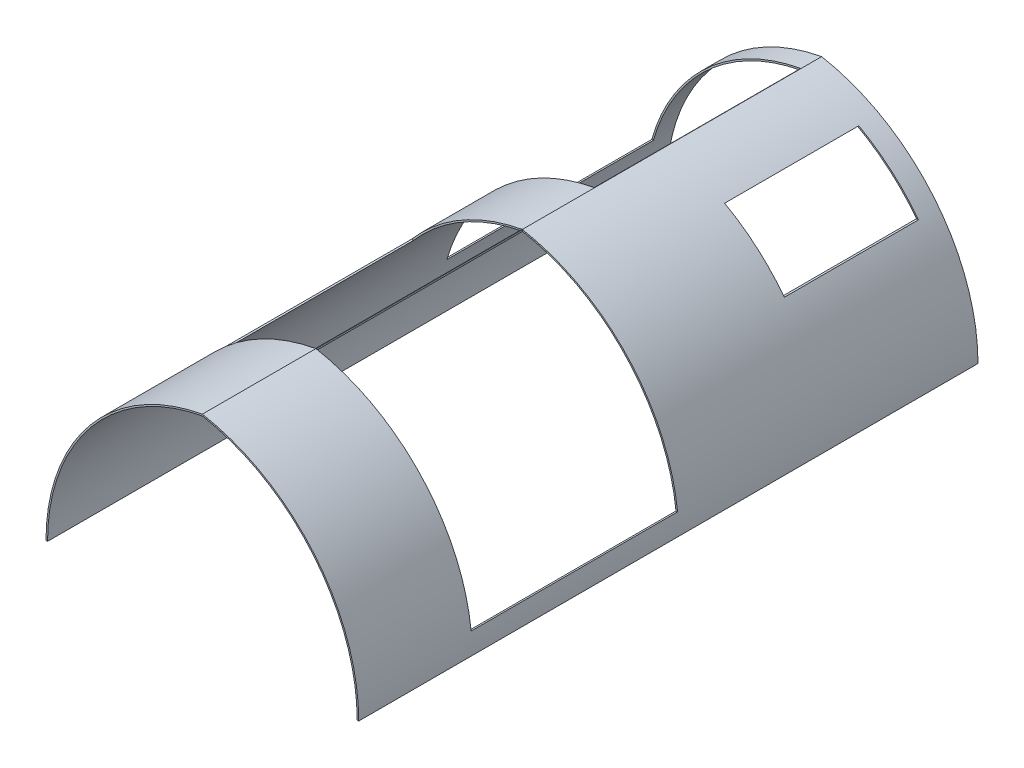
ISO-10303-21;
HEADER;
FILE_DESCRIPTION(('STEP AP214'),'2;1');
FILE_NAME('part.step','',(''),(''),'','','');
FILE_SCHEMA(('AUTOMOTIVE_DESIGN { 1 0 10303 214 1 1 1 1 }'));
ENDSEC;
DATA;
#1=APPLICATION_CONTEXT('core data for automotive mechanical design processes');
#2=APPLICATION_PROTOCOL_DEFINITION('international standard','automotive_design',2000,#1);
#3=PRODUCT_CONTEXT('',#1,'mechanical');
#4=PRODUCT('Part','Part','',(#3));
#5=PRODUCT_RELATED_PRODUCT_CATEGORY('part','',(#4));
#6=PRODUCT_DEFINITION_FORMATION('','',#4);
#7=PRODUCT_DEFINITION_CONTEXT('part definition',#1,'design');
#8=PRODUCT_DEFINITION('design','',#6,#7);
#9=PRODUCT_DEFINITION_SHAPE('','',#8);
#10=(LENGTH_UNIT() NAMED_UNIT(*) SI_UNIT(.MILLI.,.METRE.));
#11=(NAMED_UNIT(*) PLANE_ANGLE_UNIT() SI_UNIT($,.RADIAN.));
#12=(NAMED_UNIT(*) SI_UNIT($,.STERADIAN.) SOLID_ANGLE_UNIT());
#13=UNCERTAINTY_MEASURE_WITH_UNIT(LENGTH_MEASURE(1.E-05),#10,'distance_accuracy_value','');
#14=(GEOMETRIC_REPRESENTATION_CONTEXT(3) GLOBAL_UNCERTAINTY_ASSIGNED_CONTEXT((#13)) GLOBAL_UNIT_ASSIGNED_CONTEXT((#10,
#11,#12)) REPRESENTATION_CONTEXT('',''));
#15=CARTESIAN_POINT('',(0.,0.,0.));
#16=DIRECTION('',(0.,0.,1.));
#17=DIRECTION('',(1.,0.,0.));
#18=AXIS2_PLACEMENT_3D('',#15,#16,#17);
#19=CARTESIAN_POINT('',(351.335117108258,-91.3706169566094,6000.));
#20=DIRECTION('',(0.,0.,-1.));
#21=DIRECTION('',(-1.,0.,0.));
#22=AXIS2_PLACEMENT_3D('',#19,#20,#21);
#23=CYLINDRICAL_SURFACE('',#22,1833.03652149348);
#24=CARTESIAN_POINT('',(351.335117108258,-91.3706169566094,2200.));
#25=DIRECTION('',(0.,0.,-1.));
#26=DIRECTION('',(-1.,0.,0.));
#27=AXIS2_PLACEMENT_3D('',#24,#25,#26);
#28=CIRCLE('',#27,1833.03652149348);
#29=CARTESIAN_POINT('',(14.9999999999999,1710.54546825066,2200.));
#30=VERTEX_POINT('',#29);
#31=CARTESIAN_POINT('',(-1412.19058135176,408.629383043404,2200.));
#32=VERTEX_POINT('',#31);
#33=EDGE_CURVE('E218',#30,#32,#28,.F.);
#34=ORIENTED_EDGE('',*,*,#33,.F.);
#35=DIRECTION('',(0.,0.,-1.));
#36=VECTOR('',#35,1.);
#37=CARTESIAN_POINT('',(14.9999999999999,1710.54546825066,6000.));
#38=LINE('',#37,#36);
#39=CARTESIAN_POINT('',(14.9999999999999,1710.54546825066,199.999999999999));
#40=VERTEX_POINT('',#39);
#41=EDGE_CURVE('E209',#30,#40,#38,.T.);
#42=ORIENTED_EDGE('',*,*,#41,.T.);
#43=CARTESIAN_POINT('',(351.335117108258,-91.3706169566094,200.));
#44=DIRECTION('',(0.,0.,-1.));
#45=DIRECTION('',(0.,1.,0.));
#46=AXIS2_PLACEMENT_3D('',#43,#44,#45);
#47=CIRCLE('',#46,1833.03652149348);
#48=CARTESIAN_POINT('',(-1412.19058135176,408.629383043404,200.));
#49=VERTEX_POINT('',#48);
#50=EDGE_CURVE('E212',#40,#49,#47,.F.);
#51=ORIENTED_EDGE('',*,*,#50,.T.);
#52=DIRECTION('',(0.,0.,-1.));
#53=VECTOR('',#52,1.);
#54=CARTESIAN_POINT('',(-1412.19058135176,408.629383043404,6000.));
#55=LINE('',#54,#53);
#56=EDGE_CURVE('E215',#49,#32,#55,.F.);
#57=ORIENTED_EDGE('',*,*,#56,.T.);
#58=EDGE_LOOP('',(#34,#42,#51,#57));
#59=FACE_BOUND('',#58,.T.);
#60=CARTESIAN_POINT('',(351.335117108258,-91.3706169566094,0.));
#61=DIRECTION('',(0.,0.,-1.));
#62=DIRECTION('',(-1.,0.,0.));
#63=AXIS2_PLACEMENT_3D('',#60,#61,#62);
#64=CIRCLE('',#63,1833.03652149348);
#65=CARTESIAN_POINT('',(-1481.70140438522,-91.3706169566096,0.));
#66=VERTEX_POINT('',#65);
#67=CARTESIAN_POINT('',(18.2985956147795,1711.15804147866,0.));
#68=VERTEX_POINT('',#67);
#69=EDGE_CURVE('E263',#66,#68,#64,.T.);
#70=ORIENTED_EDGE('',*,*,#69,.T.);
#71=DIRECTION('',(0.,0.,-1.));
#72=VECTOR('',#71,1.);
#73=CARTESIAN_POINT('',(18.2985956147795,1711.15804147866,6000.));
#74=LINE('',#73,#72);
#75=CARTESIAN_POINT('',(18.2985956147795,1711.15804147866,6000.));
#76=VERTEX_POINT('',#75);
#77=EDGE_CURVE('E304',#76,#68,#74,.T.);
#78=ORIENTED_EDGE('',*,*,#77,.F.);
#79=CARTESIAN_POINT('',(351.335117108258,-91.3706169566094,6000.));
#80=DIRECTION('',(0.,0.,-1.));
#81=DIRECTION('',(-1.,0.,0.));
#82=AXIS2_PLACEMENT_3D('',#79,#80,#81);
#83=CIRCLE('',#82,1833.03652149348);
#84=CARTESIAN_POINT('',(-1481.70140438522,-91.3706169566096,6000.));
#85=VERTEX_POINT('',#84);
#86=EDGE_CURVE('E264',#85,#76,#83,.T.);
#87=ORIENTED_EDGE('',*,*,#86,.F.);
#88=DIRECTION('',(0.,0.,-1.));
#89=VECTOR('',#88,1.);
#90=CARTESIAN_POINT('',(-1481.70140438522,-91.3706169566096,6000.));
#91=LINE('',#90,#89);
#92=EDGE_CURVE('E278',#85,#66,#91,.T.);
#93=ORIENTED_EDGE('',*,*,#92,.T.);
#94=EDGE_LOOP('',(#70,#78,#87,#93));
#95=FACE_BOUND('',#94,.T.);
#96=CARTESIAN_POINT('',(351.335117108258,-91.3706169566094,4900.));
#97=DIRECTION('',(0.,0.,-1.));
#98=DIRECTION('',(-1.,0.,0.));
#99=AXIS2_PLACEMENT_3D('',#96,#97,#98);
#100=CIRCLE('',#99,1833.03652149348);
#101=CARTESIAN_POINT('',(14.9999999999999,1710.54546825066,4900.));
#102=VERTEX_POINT('',#101);
#103=CARTESIAN_POINT('',(-1034.31378832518,1108.6293830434,4900.));
#104=VERTEX_POINT('',#103);
#105=EDGE_CURVE('E187',#102,#104,#100,.F.);
#106=ORIENTED_EDGE('',*,*,#105,.F.);
#107=DIRECTION('',(0.,0.,-1.));
#108=VECTOR('',#107,1.);
#109=CARTESIAN_POINT('',(14.9999999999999,1710.54546825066,6000.));
#110=LINE('',#109,#108);
#111=CARTESIAN_POINT('',(14.9999999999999,1710.54546825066,2900.));
#112=VERTEX_POINT('',#111);
#113=EDGE_CURVE('E176',#102,#112,#110,.T.);
#114=ORIENTED_EDGE('',*,*,#113,.T.);
#115=CARTESIAN_POINT('',(351.335117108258,-91.3706169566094,2900.));
#116=DIRECTION('',(0.,0.,-1.));
#117=DIRECTION('',(-1.,0.,0.));
#118=AXIS2_PLACEMENT_3D('',#115,#116,#117);
#119=CIRCLE('',#118,1833.03652149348);
#120=CARTESIAN_POINT('',(-1034.31378832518,1108.6293830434,2900.));
#121=VERTEX_POINT('',#120);
#122=EDGE_CURVE('E181',#112,#121,#119,.F.);
#123=ORIENTED_EDGE('',*,*,#122,.T.);
#124=DIRECTION('',(0.,0.,-1.));
#125=VECTOR('',#124,1.);
#126=CARTESIAN_POINT('',(-1034.31378832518,1108.6293830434,6000.));
#127=LINE('',#126,#125);
#128=EDGE_CURVE('E193',#121,#104,#127,.F.);
#129=ORIENTED_EDGE('',*,*,#128,.T.);
#130=EDGE_LOOP('',(#106,#114,#123,#129));
#131=FACE_BOUND('',#130,.T.);
#132=ADVANCED_FACE('F32',(#59,#95,#131),#23,.F.);
#133=CARTESIAN_POINT('',(351.335117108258,-91.3706169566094,6000.));
#134=DIRECTION('',(0.,0.,-1.));
#135=DIRECTION('',(-1.,0.,0.));
#136=AXIS2_PLACEMENT_3D('',#133,#134,#135);
#137=CYLINDRICAL_SURFACE('',#136,1848.03652149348);
#138=CARTESIAN_POINT('',(351.335117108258,-91.3706169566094,2200.));
#139=DIRECTION('',(0.,0.,-1.));
#140=DIRECTION('',(-1.,0.,0.));
#141=AXIS2_PLACEMENT_3D('',#138,#139,#140);
#142=CIRCLE('',#141,1848.03652149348);
#143=CARTESIAN_POINT('',(-1427.77673569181,408.629383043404,2200.));
#144=VERTEX_POINT('',#143);
#145=CARTESIAN_POINT('',(14.9999999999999,1725.8023725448,2200.));
#146=VERTEX_POINT('',#145);
#147=EDGE_CURVE('E337',#144,#146,#142,.T.);
#148=ORIENTED_EDGE('',*,*,#147,.F.);
#149=DIRECTION('',(0.,0.,-1.));
#150=VECTOR('',#149,1.);
#151=CARTESIAN_POINT('',(-1427.77673569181,408.629383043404,6000.));
#152=LINE('',#151,#150);
#153=CARTESIAN_POINT('',(-1427.77673569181,408.629383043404,200.));
#154=VERTEX_POINT('',#153);
#155=EDGE_CURVE('E334',#144,#154,#152,.T.);
#156=ORIENTED_EDGE('',*,*,#155,.T.);
#157=CARTESIAN_POINT('',(351.335117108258,-91.3706169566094,200.));
#158=DIRECTION('',(0.,0.,-1.));
#159=DIRECTION('',(0.,1.,0.));
#160=AXIS2_PLACEMENT_3D('',#157,#158,#159);
#161=CIRCLE('',#160,1848.03652149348);
#162=CARTESIAN_POINT('',(14.9999999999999,1725.8023725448,200.));
#163=VERTEX_POINT('',#162);
#164=EDGE_CURVE('E331',#154,#163,#161,.T.);
#165=ORIENTED_EDGE('',*,*,#164,.T.);
#166=DIRECTION('',(0.,0.,-1.));
#167=VECTOR('',#166,1.);
#168=CARTESIAN_POINT('',(14.9999999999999,1725.8023725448,6000.));
#169=LINE('',#168,#167);
#170=EDGE_CURVE('E328',#163,#146,#169,.F.);
#171=ORIENTED_EDGE('',*,*,#170,.T.);
#172=EDGE_LOOP('',(#148,#156,#165,#171));
#173=FACE_BOUND('',#172,.T.);
#174=CARTESIAN_POINT('',(351.335117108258,-91.3706169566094,0.));
#175=DIRECTION('',(0.,0.,1.));
#176=DIRECTION('',(-1.,0.,0.));
#177=AXIS2_PLACEMENT_3D('',#174,#175,#176);
#178=CIRCLE('',#177,1848.03652149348);
#179=CARTESIAN_POINT('',(18.2985956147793,1726.40980436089,0.));
#180=VERTEX_POINT('',#179);
#181=CARTESIAN_POINT('',(-1496.70140438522,-91.3706169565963,0.));
#182=VERTEX_POINT('',#181);
#183=EDGE_CURVE('E287',#180,#182,#178,.T.);
#184=ORIENTED_EDGE('',*,*,#183,.T.);
#185=DIRECTION('',(0.,0.,-1.));
#186=VECTOR('',#185,1.);
#187=CARTESIAN_POINT('',(-1496.70140438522,-91.3706169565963,6000.));
#188=LINE('',#187,#186);
#189=CARTESIAN_POINT('',(-1496.70140438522,-91.3706169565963,6000.));
#190=VERTEX_POINT('',#189);
#191=EDGE_CURVE('E292',#190,#182,#188,.T.);
#192=ORIENTED_EDGE('',*,*,#191,.F.);
#193=CARTESIAN_POINT('',(351.335117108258,-91.3706169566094,6000.));
#194=DIRECTION('',(0.,0.,1.));
#195=DIRECTION('',(-1.,0.,0.));
#196=AXIS2_PLACEMENT_3D('',#193,#194,#195);
#197=CIRCLE('',#196,1848.03652149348);
#198=CARTESIAN_POINT('',(18.2985956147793,1726.40980436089,6000.));
#199=VERTEX_POINT('',#198);
#200=EDGE_CURVE('E274',#199,#190,#197,.T.);
#201=ORIENTED_EDGE('',*,*,#200,.F.);
#202=DIRECTION('',(0.,0.,-1.));
#203=VECTOR('',#202,1.);
#204=CARTESIAN_POINT('',(18.2985956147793,1726.40980436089,6000.));
#205=LINE('',#204,#203);
#206=EDGE_CURVE('E295',#199,#180,#205,.T.);
#207=ORIENTED_EDGE('',*,*,#206,.T.);
#208=EDGE_LOOP('',(#184,#192,#201,#207));
#209=FACE_BOUND('',#208,.T.);
#210=CARTESIAN_POINT('',(351.335117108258,-91.3706169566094,4900.));
#211=DIRECTION('',(0.,0.,-1.));
#212=DIRECTION('',(-1.,0.,0.));
#213=AXIS2_PLACEMENT_3D('',#210,#211,#212);
#214=CIRCLE('',#213,1848.03652149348);
#215=CARTESIAN_POINT('',(-1054.09683954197,1108.6293830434,4900.));
#216=VERTEX_POINT('',#215);
#217=CARTESIAN_POINT('',(14.9999999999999,1725.8023725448,4900.));
#218=VERTEX_POINT('',#217);
#219=EDGE_CURVE('E11',#216,#218,#214,.T.);
#220=ORIENTED_EDGE('',*,*,#219,.F.);
#221=DIRECTION('',(0.,0.,-1.));
#222=VECTOR('',#221,1.);
#223=CARTESIAN_POINT('',(-1054.09683954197,1108.6293830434,6000.));
#224=LINE('',#223,#222);
#225=CARTESIAN_POINT('',(-1054.09683954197,1108.6293830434,2900.));
#226=VERTEX_POINT('',#225);
#227=EDGE_CURVE('E39',#216,#226,#224,.T.);
#228=ORIENTED_EDGE('',*,*,#227,.T.);
#229=CARTESIAN_POINT('',(351.335117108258,-91.3706169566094,2900.));
#230=DIRECTION('',(0.,0.,-1.));
#231=DIRECTION('',(-1.,0.,0.));
#232=AXIS2_PLACEMENT_3D('',#229,#230,#231);
#233=CIRCLE('',#232,1848.03652149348);
#234=CARTESIAN_POINT('',(14.9999999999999,1725.8023725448,2900.));
#235=VERTEX_POINT('',#234);
#236=EDGE_CURVE('E342',#226,#235,#233,.T.);
#237=ORIENTED_EDGE('',*,*,#236,.T.);
#238=DIRECTION('',(0.,0.,-1.));
#239=VECTOR('',#238,1.);
#240=CARTESIAN_POINT('',(14.9999999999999,1725.8023725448,6000.));
#241=LINE('',#240,#239);
#242=EDGE_CURVE('E340',#235,#218,#241,.F.);
#243=ORIENTED_EDGE('',*,*,#242,.T.);
#244=EDGE_LOOP('',(#220,#228,#237,#243));
#245=FACE_BOUND('',#244,.T.);
#246=ADVANCED_FACE('F346',(#173,#209,#245),#137,.T.);
#247=CARTESIAN_POINT('',(-314.737925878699,-91.3706169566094,6000.));
#248=DIRECTION('',(0.,0.,-1.));
#249=DIRECTION('',(-1.,0.,0.));
#250=AXIS2_PLACEMENT_3D('',#247,#248,#249);
#251=CYLINDRICAL_SURFACE('',#250,1833.03652149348);
#252=CARTESIAN_POINT('',(-314.737925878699,-91.3706169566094,4900.));
#253=DIRECTION('',(0.,0.,-1.));
#254=DIRECTION('',(-1.,0.,0.));
#255=AXIS2_PLACEMENT_3D('',#252,#253,#254);
#256=CIRCLE('',#255,1833.03652149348);
#257=CARTESIAN_POINT('',(1507.35507096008,108.629383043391,4900.));
#258=VERTEX_POINT('',#257);
#259=CARTESIAN_POINT('',(20.,1710.84285821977,4900.));
#260=VERTEX_POINT('',#259);
#261=EDGE_CURVE('E236',#258,#260,#256,.F.);
#262=ORIENTED_EDGE('',*,*,#261,.F.);
#263=DIRECTION('',(0.,0.,-1.));
#264=VECTOR('',#263,1.);
#265=CARTESIAN_POINT('',(1507.35507096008,108.629383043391,6000.));
#266=LINE('',#265,#264);
#267=CARTESIAN_POINT('',(1507.35507096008,108.629383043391,2900.));
#268=VERTEX_POINT('',#267);
#269=EDGE_CURVE('E239',#258,#268,#266,.T.);
#270=ORIENTED_EDGE('',*,*,#269,.T.);
#271=CARTESIAN_POINT('',(-314.737925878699,-91.3706169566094,2900.));
#272=DIRECTION('',(0.,0.,-1.));
#273=DIRECTION('',(-1.,0.,0.));
#274=AXIS2_PLACEMENT_3D('',#271,#272,#273);
#275=CIRCLE('',#274,1833.03652149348);
#276=CARTESIAN_POINT('',(20.,1710.84285821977,2900.));
#277=VERTEX_POINT('',#276);
#278=EDGE_CURVE('E233',#268,#277,#275,.F.);
#279=ORIENTED_EDGE('',*,*,#278,.T.);
#280=DIRECTION('',(0.,0.,-1.));
#281=VECTOR('',#280,1.);
#282=CARTESIAN_POINT('',(20.,1710.84285821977,6000.));
#283=LINE('',#282,#281);
#284=EDGE_CURVE('E229',#260,#277,#283,.T.);
#285=ORIENTED_EDGE('',*,*,#284,.F.);
#286=EDGE_LOOP('',(#262,#270,#279,#285));
#287=FACE_BOUND('',#286,.T.);
#288=CARTESIAN_POINT('',(-314.737925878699,-91.3706169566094,0.));
#289=DIRECTION('',(0.,0.,-1.));
#290=DIRECTION('',(1.,0.,0.));
#291=AXIS2_PLACEMENT_3D('',#288,#289,#290);
#292=CIRCLE('',#291,1833.03652149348);
#293=CARTESIAN_POINT('',(1518.29859561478,-91.3706169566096,0.));
#294=VERTEX_POINT('',#293);
#295=EDGE_CURVE('E281',#68,#294,#292,.T.);
#296=ORIENTED_EDGE('',*,*,#295,.T.);
#297=DIRECTION('',(0.,0.,-1.));
#298=VECTOR('',#297,1.);
#299=CARTESIAN_POINT('',(1518.29859561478,-91.3706169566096,6000.));
#300=LINE('',#299,#298);
#301=CARTESIAN_POINT('',(1518.29859561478,-91.3706169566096,6000.));
#302=VERTEX_POINT('',#301);
#303=EDGE_CURVE('E301',#302,#294,#300,.T.);
#304=ORIENTED_EDGE('',*,*,#303,.F.);
#305=CARTESIAN_POINT('',(-314.737925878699,-91.3706169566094,6000.));
#306=DIRECTION('',(0.,0.,-1.));
#307=DIRECTION('',(1.,0.,0.));
#308=AXIS2_PLACEMENT_3D('',#305,#306,#307);
#309=CIRCLE('',#308,1833.03652149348);
#310=EDGE_CURVE('E267',#76,#302,#309,.T.);
#311=ORIENTED_EDGE('',*,*,#310,.F.);
#312=ORIENTED_EDGE('',*,*,#77,.T.);
#313=EDGE_LOOP('',(#296,#304,#311,#312));
#314=FACE_BOUND('',#313,.T.);
#315=CARTESIAN_POINT('',(-314.737925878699,-91.3706169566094,200.));
#316=DIRECTION('',(0.,0.,1.));
#317=DIRECTION('',(1.,0.,0.));
#318=AXIS2_PLACEMENT_3D('',#315,#316,#317);
#319=CIRCLE('',#318,1833.03652149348);
#320=CARTESIAN_POINT('',(547.125983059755,1526.40980436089,200.));
#321=VERTEX_POINT('',#320);
#322=CARTESIAN_POINT('',(1138.04898858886,1026.40980436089,200.));
#323=VERTEX_POINT('',#322);
#324=EDGE_CURVE('E261',#321,#323,#319,.F.);
#325=ORIENTED_EDGE('',*,*,#324,.F.);
#326=DIRECTION('',(0.,0.,-1.));
#327=VECTOR('',#326,1.);
#328=CARTESIAN_POINT('',(547.125983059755,1526.40980436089,6000.));
#329=LINE('',#328,#327);
#330=CARTESIAN_POINT('',(547.125983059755,1526.40980436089,1500.));
#331=VERTEX_POINT('',#330);
#332=EDGE_CURVE('E246',#331,#321,#329,.T.);
#333=ORIENTED_EDGE('',*,*,#332,.F.);
#334=CARTESIAN_POINT('',(-314.737925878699,-91.3706169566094,1500.));
#335=DIRECTION('',(0.,0.,1.));
#336=DIRECTION('',(1.,0.,0.));
#337=AXIS2_PLACEMENT_3D('',#334,#335,#336);
#338=CIRCLE('',#337,1833.03652149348);
#339=CARTESIAN_POINT('',(1138.04898858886,1026.40980436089,1500.));
#340=VERTEX_POINT('',#339);
#341=EDGE_CURVE('E255',#331,#340,#338,.F.);
#342=ORIENTED_EDGE('',*,*,#341,.T.);
#343=DIRECTION('',(0.,0.,-1.));
#344=VECTOR('',#343,1.);
#345=CARTESIAN_POINT('',(1138.04898858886,1026.40980436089,6000.));
#346=LINE('',#345,#344);
#347=EDGE_CURVE('E258',#340,#323,#346,.T.);
#348=ORIENTED_EDGE('',*,*,#347,.T.);
#349=EDGE_LOOP('',(#325,#333,#342,#348));
#350=FACE_BOUND('',#349,.T.);
#351=ADVANCED_FACE('F370',(#287,#314,#350),#251,.F.);
#352=CARTESIAN_POINT('',(-314.737925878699,-91.3706169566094,6000.));
#353=DIRECTION('',(0.,0.,-1.));
#354=DIRECTION('',(-1.,0.,0.));
#355=AXIS2_PLACEMENT_3D('',#352,#353,#354);
#356=CYLINDRICAL_SURFACE('',#355,1848.03652149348);
#357=CARTESIAN_POINT('',(-314.737925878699,-91.3706169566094,2900.));
#358=DIRECTION('',(0.,0.,-1.));
#359=DIRECTION('',(-1.,0.,0.));
#360=AXIS2_PLACEMENT_3D('',#357,#358,#359);
#361=CIRCLE('',#360,1848.03652149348);
#362=CARTESIAN_POINT('',(20.,1726.09726604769,2900.));
#363=VERTEX_POINT('',#362);
#364=CARTESIAN_POINT('',(1522.44442347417,108.629383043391,2900.));
#365=VERTEX_POINT('',#364);
#366=EDGE_CURVE('E320',#363,#365,#361,.T.);
#367=ORIENTED_EDGE('',*,*,#366,.T.);
#368=DIRECTION('',(0.,0.,-1.));
#369=VECTOR('',#368,1.);
#370=CARTESIAN_POINT('',(1522.44442347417,108.629383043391,6000.));
#371=LINE('',#370,#369);
#372=CARTESIAN_POINT('',(1522.44442347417,108.629383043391,4900.));
#373=VERTEX_POINT('',#372);
#374=EDGE_CURVE('E325',#365,#373,#371,.F.);
#375=ORIENTED_EDGE('',*,*,#374,.T.);
#376=CARTESIAN_POINT('',(-314.737925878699,-91.3706169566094,4900.));
#377=DIRECTION('',(0.,0.,-1.));
#378=DIRECTION('',(-1.,0.,0.));
#379=AXIS2_PLACEMENT_3D('',#376,#377,#378);
#380=CIRCLE('',#379,1848.03652149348);
#381=CARTESIAN_POINT('',(20.,1726.09726604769,4900.));
#382=VERTEX_POINT('',#381);
#383=EDGE_CURVE('E323',#382,#373,#380,.T.);
#384=ORIENTED_EDGE('',*,*,#383,.F.);
#385=DIRECTION('',(0.,0.,-1.));
#386=VECTOR('',#385,1.);
#387=CARTESIAN_POINT('',(20.,1726.09726604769,6000.));
#388=LINE('',#387,#386);
#389=EDGE_CURVE('E318',#363,#382,#388,.F.);
#390=ORIENTED_EDGE('',*,*,#389,.F.);
#391=EDGE_LOOP('',(#367,#375,#384,#390));
#392=FACE_BOUND('',#391,.T.);
#393=CARTESIAN_POINT('',(-314.737925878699,-91.3706169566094,0.));
#394=DIRECTION('',(0.,0.,1.));
#395=DIRECTION('',(1.,0.,0.));
#396=AXIS2_PLACEMENT_3D('',#393,#394,#395);
#397=CIRCLE('',#396,1848.03652149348);
#398=CARTESIAN_POINT('',(1533.29859561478,-91.3706169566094,0.));
#399=VERTEX_POINT('',#398);
#400=EDGE_CURVE('E285',#399,#180,#397,.T.);
#401=ORIENTED_EDGE('',*,*,#400,.T.);
#402=ORIENTED_EDGE('',*,*,#206,.F.);
#403=CARTESIAN_POINT('',(-314.737925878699,-91.3706169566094,6000.));
#404=DIRECTION('',(0.,0.,1.));
#405=DIRECTION('',(1.,0.,0.));
#406=AXIS2_PLACEMENT_3D('',#403,#404,#405);
#407=CIRCLE('',#406,1848.03652149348);
#408=CARTESIAN_POINT('',(1533.29859561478,-91.3706169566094,6000.));
#409=VERTEX_POINT('',#408);
#410=EDGE_CURVE('E272',#409,#199,#407,.T.);
#411=ORIENTED_EDGE('',*,*,#410,.F.);
#412=DIRECTION('',(0.,0.,-1.));
#413=VECTOR('',#412,1.);
#414=CARTESIAN_POINT('',(1533.29859561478,-91.3706169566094,6000.));
#415=LINE('',#414,#413);
#416=EDGE_CURVE('E298',#409,#399,#415,.T.);
#417=ORIENTED_EDGE('',*,*,#416,.T.);
#418=EDGE_LOOP('',(#401,#402,#411,#417));
#419=FACE_BOUND('',#418,.T.);
#420=CARTESIAN_POINT('',(-314.737925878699,-91.3706169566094,200.));
#421=DIRECTION('',(0.,0.,1.));
#422=DIRECTION('',(1.,0.,0.));
#423=AXIS2_PLACEMENT_3D('',#420,#421,#422);
#424=CIRCLE('',#423,1848.03652149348);
#425=CARTESIAN_POINT('',(1156.92980648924,1026.40980436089,200.));
#426=VERTEX_POINT('',#425);
#427=CARTESIAN_POINT('',(578.584800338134,1526.40980436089,199.999999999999));
#428=VERTEX_POINT('',#427);
#429=EDGE_CURVE('E315',#426,#428,#424,.T.);
#430=ORIENTED_EDGE('',*,*,#429,.F.);
#431=DIRECTION('',(0.,0.,-1.));
#432=VECTOR('',#431,1.);
#433=CARTESIAN_POINT('',(1156.92980648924,1026.40980436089,6000.));
#434=LINE('',#433,#432);
#435=CARTESIAN_POINT('',(1156.92980648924,1026.40980436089,1500.));
#436=VERTEX_POINT('',#435);
#437=EDGE_CURVE('E312',#426,#436,#434,.F.);
#438=ORIENTED_EDGE('',*,*,#437,.T.);
#439=CARTESIAN_POINT('',(-314.737925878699,-91.3706169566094,1500.));
#440=DIRECTION('',(0.,0.,1.));
#441=DIRECTION('',(1.,0.,0.));
#442=AXIS2_PLACEMENT_3D('',#439,#440,#441);
#443=CIRCLE('',#442,1848.03652149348);
#444=CARTESIAN_POINT('',(578.584800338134,1526.40980436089,1500.));
#445=VERTEX_POINT('',#444);
#446=EDGE_CURVE('E309',#436,#445,#443,.T.);
#447=ORIENTED_EDGE('',*,*,#446,.T.);
#448=DIRECTION('',(0.,0.,-1.));
#449=VECTOR('',#448,1.);
#450=CARTESIAN_POINT('',(578.584800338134,1526.40980436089,6000.));
#451=LINE('',#450,#449);
#452=EDGE_CURVE('E307',#428,#445,#451,.F.);
#453=ORIENTED_EDGE('',*,*,#452,.F.);
#454=EDGE_LOOP('',(#430,#438,#447,#453));
#455=FACE_BOUND('',#454,.T.);
#456=ADVANCED_FACE('F399',(#392,#419,#455),#356,.T.);
#457=CARTESIAN_POINT('',(1518.29859561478,-91.3706169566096,6000.));
#458=DIRECTION('',(0.,1.,0.));
#459=DIRECTION('',(-1.,0.,0.));
#460=AXIS2_PLACEMENT_3D('',#457,#458,#459);
#461=PLANE('',#460);
#462=DIRECTION('',(1.,0.,0.));
#463=VECTOR('',#462,1.);
#464=CARTESIAN_POINT('',(1518.29859561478,-91.3706169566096,0.));
#465=LINE('',#464,#463);
#466=EDGE_CURVE('E283',#294,#399,#465,.T.);
#467=ORIENTED_EDGE('',*,*,#466,.T.);
#468=ORIENTED_EDGE('',*,*,#416,.F.);
#469=DIRECTION('',(1.,0.,0.));
#470=VECTOR('',#469,1.);
#471=CARTESIAN_POINT('',(1518.29859561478,-91.3706169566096,6000.));
#472=LINE('',#471,#470);
#473=EDGE_CURVE('E270',#302,#409,#472,.T.);
#474=ORIENTED_EDGE('',*,*,#473,.F.);
#475=ORIENTED_EDGE('',*,*,#303,.T.);
#476=EDGE_LOOP('',(#467,#468,#474,#475));
#477=FACE_BOUND('',#476,.T.);
#478=ADVANCED_FACE('F404',(#477),#461,.F.);
#479=CARTESIAN_POINT('',(-1481.70140438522,-91.3706169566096,6000.));
#480=DIRECTION('',(8.86328047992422E-13,1.,0.));
#481=DIRECTION('',(-1.,8.86328047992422E-13,0.));
#482=AXIS2_PLACEMENT_3D('',#479,#480,#481);
#483=PLANE('',#482);
#484=DIRECTION('',(1.,-8.86328047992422E-13,0.));
#485=VECTOR('',#484,1.);
#486=CARTESIAN_POINT('',(-1481.70140438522,-91.3706169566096,0.));
#487=LINE('',#486,#485);
#488=EDGE_CURVE('E268',#182,#66,#487,.T.);
#489=ORIENTED_EDGE('',*,*,#488,.T.);
#490=ORIENTED_EDGE('',*,*,#92,.F.);
#491=DIRECTION('',(1.,-8.86328047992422E-13,0.));
#492=VECTOR('',#491,1.);
#493=CARTESIAN_POINT('',(-1481.70140438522,-91.3706169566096,6000.));
#494=LINE('',#493,#492);
#495=EDGE_CURVE('E276',#190,#85,#494,.T.);
#496=ORIENTED_EDGE('',*,*,#495,.F.);
#497=ORIENTED_EDGE('',*,*,#191,.T.);
#498=EDGE_LOOP('',(#489,#490,#496,#497));
#499=FACE_BOUND('',#498,.T.);
#500=ADVANCED_FACE('F395',(#499),#483,.F.);
#501=CARTESIAN_POINT('',(351.335117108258,-91.3706169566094,6000.));
#502=DIRECTION('',(0.,0.,-1.));
#503=DIRECTION('',(-1.,0.,0.));
#504=AXIS2_PLACEMENT_3D('',#501,#502,#503);
#505=PLANE('',#504);
#506=ORIENTED_EDGE('',*,*,#86,.T.);
#507=ORIENTED_EDGE('',*,*,#310,.T.);
#508=ORIENTED_EDGE('',*,*,#473,.T.);
#509=ORIENTED_EDGE('',*,*,#410,.T.);
#510=ORIENTED_EDGE('',*,*,#200,.T.);
#511=ORIENTED_EDGE('',*,*,#495,.T.);
#512=EDGE_LOOP('',(#506,#507,#508,#509,#510,#511));
#513=FACE_BOUND('',#512,.T.);
#514=ADVANCED_FACE('F390',(#513),#505,.F.);
#515=CARTESIAN_POINT('',(351.335117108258,-91.3706169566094,0.));
#516=DIRECTION('',(0.,0.,-1.));
#517=DIRECTION('',(-1.,0.,0.));
#518=AXIS2_PLACEMENT_3D('',#515,#516,#517);
#519=PLANE('',#518);
#520=ORIENTED_EDGE('',*,*,#69,.F.);
#521=ORIENTED_EDGE('',*,*,#488,.F.);
#522=ORIENTED_EDGE('',*,*,#183,.F.);
#523=ORIENTED_EDGE('',*,*,#400,.F.);
#524=ORIENTED_EDGE('',*,*,#466,.F.);
#525=ORIENTED_EDGE('',*,*,#295,.F.);
#526=EDGE_LOOP('',(#520,#521,#522,#523,#524,#525));
#527=FACE_BOUND('',#526,.T.);
#528=ADVANCED_FACE('F381',(#527),#519,.T.);
#529=CARTESIAN_POINT('',(0.,0.,200.));
#530=DIRECTION('',(0.,0.,1.));
#531=DIRECTION('',(1.,0.,0.));
#532=AXIS2_PLACEMENT_3D('',#529,#530,#531);
#533=PLANE('',#532);
#534=ORIENTED_EDGE('',*,*,#324,.T.);
#535=DIRECTION('',(1.,0.,0.));
#536=VECTOR('',#535,1.);
#537=CARTESIAN_POINT('',(0.,1026.40980436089,200.));
#538=LINE('',#537,#536);
#539=EDGE_CURVE('E243',#323,#426,#538,.T.);
#540=ORIENTED_EDGE('',*,*,#539,.T.);
#541=ORIENTED_EDGE('',*,*,#429,.T.);
#542=DIRECTION('',(1.,0.,0.));
#543=VECTOR('',#542,1.);
#544=CARTESIAN_POINT('',(0.,1526.40980436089,200.));
#545=LINE('',#544,#543);
#546=EDGE_CURVE('E242',#321,#428,#545,.T.);
#547=ORIENTED_EDGE('',*,*,#546,.F.);
#548=EDGE_LOOP('',(#534,#540,#541,#547));
#549=FACE_BOUND('',#548,.T.);
#550=ADVANCED_FACE('F456',(#549),#533,.T.);
#551=CARTESIAN_POINT('',(0.,1026.40980436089,0.));
#552=DIRECTION('',(0.,-1.,0.));
#553=DIRECTION('',(0.,0.,-1.));
#554=AXIS2_PLACEMENT_3D('',#551,#552,#553);
#555=PLANE('',#554);
#556=DIRECTION('',(1.,0.,0.));
#557=VECTOR('',#556,1.);
#558=CARTESIAN_POINT('',(0.,1026.40980436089,1500.));
#559=LINE('',#558,#557);
#560=EDGE_CURVE('E247',#340,#436,#559,.T.);
#561=ORIENTED_EDGE('',*,*,#560,.T.);
#562=ORIENTED_EDGE('',*,*,#437,.F.);
#563=ORIENTED_EDGE('',*,*,#539,.F.);
#564=ORIENTED_EDGE('',*,*,#347,.F.);
#565=EDGE_LOOP('',(#561,#562,#563,#564));
#566=FACE_BOUND('',#565,.T.);
#567=ADVANCED_FACE('F452',(#566),#555,.F.);
#568=CARTESIAN_POINT('',(0.,0.,1500.));
#569=DIRECTION('',(0.,0.,1.));
#570=DIRECTION('',(1.,0.,0.));
#571=AXIS2_PLACEMENT_3D('',#568,#569,#570);
#572=PLANE('',#571);
#573=DIRECTION('',(1.,0.,0.));
#574=VECTOR('',#573,1.);
#575=CARTESIAN_POINT('',(0.,1526.40980436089,1500.));
#576=LINE('',#575,#574);
#577=EDGE_CURVE('E250',#331,#445,#576,.T.);
#578=ORIENTED_EDGE('',*,*,#577,.T.);
#579=ORIENTED_EDGE('',*,*,#446,.F.);
#580=ORIENTED_EDGE('',*,*,#560,.F.);
#581=ORIENTED_EDGE('',*,*,#341,.F.);
#582=EDGE_LOOP('',(#578,#579,#580,#581));
#583=FACE_BOUND('',#582,.T.);
#584=ADVANCED_FACE('F455',(#583),#572,.F.);
#585=CARTESIAN_POINT('',(0.,1526.40980436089,0.));
#586=DIRECTION('',(0.,-1.,0.));
#587=DIRECTION('',(0.,0.,-1.));
#588=AXIS2_PLACEMENT_3D('',#585,#586,#587);
#589=PLANE('',#588);
#590=ORIENTED_EDGE('',*,*,#332,.T.);
#591=ORIENTED_EDGE('',*,*,#546,.T.);
#592=ORIENTED_EDGE('',*,*,#452,.T.);
#593=ORIENTED_EDGE('',*,*,#577,.F.);
#594=EDGE_LOOP('',(#590,#591,#592,#593));
#595=FACE_BOUND('',#594,.T.);
#596=ADVANCED_FACE('F451',(#595),#589,.T.);
#597=CARTESIAN_POINT('',(20.,108.629383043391,0.));
#598=DIRECTION('',(0.,-1.,0.));
#599=DIRECTION('',(0.,0.,-1.));
#600=AXIS2_PLACEMENT_3D('',#597,#598,#599);
#601=PLANE('',#600);
#602=DIRECTION('',(1.,0.,0.));
#603=VECTOR('',#602,1.);
#604=CARTESIAN_POINT('',(20.,108.629383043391,4900.));
#605=LINE('',#604,#603);
#606=EDGE_CURVE('E226',#258,#373,#605,.T.);
#607=ORIENTED_EDGE('',*,*,#606,.T.);
#608=ORIENTED_EDGE('',*,*,#374,.F.);
#609=DIRECTION('',(1.,0.,0.));
#610=VECTOR('',#609,1.);
#611=CARTESIAN_POINT('',(20.,108.629383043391,2900.));
#612=LINE('',#611,#610);
#613=EDGE_CURVE('E225',#268,#365,#612,.T.);
#614=ORIENTED_EDGE('',*,*,#613,.F.);
#615=ORIENTED_EDGE('',*,*,#269,.F.);
#616=EDGE_LOOP('',(#607,#608,#614,#615));
#617=FACE_BOUND('',#616,.T.);
#618=ADVANCED_FACE('F425',(#617),#601,.F.);
#619=CARTESIAN_POINT('',(20.,0.,4900.));
#620=DIRECTION('',(0.,0.,-1.));
#621=DIRECTION('',(-1.,0.,0.));
#622=AXIS2_PLACEMENT_3D('',#619,#620,#621);
#623=PLANE('',#622);
#624=ORIENTED_EDGE('',*,*,#261,.T.);
#625=DIRECTION('',(0.,1.,0.));
#626=VECTOR('',#625,1.);
#627=CARTESIAN_POINT('',(20.,0.,4900.));
#628=LINE('',#627,#626);
#629=EDGE_CURVE('E222',#260,#382,#628,.T.);
#630=ORIENTED_EDGE('',*,*,#629,.T.);
#631=ORIENTED_EDGE('',*,*,#383,.T.);
#632=ORIENTED_EDGE('',*,*,#606,.F.);
#633=EDGE_LOOP('',(#624,#630,#631,#632));
#634=FACE_BOUND('',#633,.T.);
#635=ADVANCED_FACE('F422',(#634),#623,.T.);
#636=CARTESIAN_POINT('',(20.,0.,2900.));
#637=DIRECTION('',(0.,0.,-1.));
#638=DIRECTION('',(-1.,0.,0.));
#639=AXIS2_PLACEMENT_3D('',#636,#637,#638);
#640=PLANE('',#639);
#641=ORIENTED_EDGE('',*,*,#613,.T.);
#642=ORIENTED_EDGE('',*,*,#366,.F.);
#643=DIRECTION('',(0.,1.,0.));
#644=VECTOR('',#643,1.);
#645=CARTESIAN_POINT('',(20.,0.,2900.));
#646=LINE('',#645,#644);
#647=EDGE_CURVE('E220',#277,#363,#646,.T.);
#648=ORIENTED_EDGE('',*,*,#647,.F.);
#649=ORIENTED_EDGE('',*,*,#278,.F.);
#650=EDGE_LOOP('',(#641,#642,#648,#649));
#651=FACE_BOUND('',#650,.T.);
#652=ADVANCED_FACE('F431',(#651),#640,.F.);
#653=CARTESIAN_POINT('',(20.,0.,0.));
#654=DIRECTION('',(1.,0.,0.));
#655=DIRECTION('',(0.,0.,-1.));
#656=AXIS2_PLACEMENT_3D('',#653,#654,#655);
#657=PLANE('',#656);
#658=ORIENTED_EDGE('',*,*,#284,.T.);
#659=ORIENTED_EDGE('',*,*,#647,.T.);
#660=ORIENTED_EDGE('',*,*,#389,.T.);
#661=ORIENTED_EDGE('',*,*,#629,.F.);
#662=EDGE_LOOP('',(#658,#659,#660,#661));
#663=FACE_BOUND('',#662,.T.);
#664=ADVANCED_FACE('F433',(#663),#657,.T.);
#665=CARTESIAN_POINT('',(14.9999999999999,0.,2200.));
#666=DIRECTION('',(0.,0.,-1.));
#667=DIRECTION('',(-1.,0.,0.));
#668=AXIS2_PLACEMENT_3D('',#665,#666,#667);
#669=PLANE('',#668);
#670=ORIENTED_EDGE('',*,*,#33,.T.);
#671=DIRECTION('',(-1.,0.,0.));
#672=VECTOR('',#671,1.);
#673=CARTESIAN_POINT('',(14.9999999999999,408.629383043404,2200.));
#674=LINE('',#673,#672);
#675=EDGE_CURVE('E206',#32,#144,#674,.T.);
#676=ORIENTED_EDGE('',*,*,#675,.T.);
#677=ORIENTED_EDGE('',*,*,#147,.T.);
#678=DIRECTION('',(0.,-1.,0.));
#679=VECTOR('',#678,1.);
#680=CARTESIAN_POINT('',(14.9999999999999,0.,2200.));
#681=LINE('',#680,#679);
#682=EDGE_CURVE('E194',#146,#30,#681,.T.);
#683=ORIENTED_EDGE('',*,*,#682,.T.);
#684=EDGE_LOOP('',(#670,#676,#677,#683));
#685=FACE_BOUND('',#684,.T.);
#686=ADVANCED_FACE('F435',(#685),#669,.T.);
#687=CARTESIAN_POINT('',(14.9999999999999,408.629383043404,0.));
#688=DIRECTION('',(0.,-1.,0.));
#689=DIRECTION('',(0.,0.,-1.));
#690=AXIS2_PLACEMENT_3D('',#687,#688,#689);
#691=PLANE('',#690);
#692=DIRECTION('',(-1.,0.,0.));
#693=VECTOR('',#692,1.);
#694=CARTESIAN_POINT('',(14.9999999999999,408.629383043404,200.));
#695=LINE('',#694,#693);
#696=EDGE_CURVE('E203',#49,#154,#695,.T.);
#697=ORIENTED_EDGE('',*,*,#696,.T.);
#698=ORIENTED_EDGE('',*,*,#155,.F.);
#699=ORIENTED_EDGE('',*,*,#675,.F.);
#700=ORIENTED_EDGE('',*,*,#56,.F.);
#701=EDGE_LOOP('',(#697,#698,#699,#700));
#702=FACE_BOUND('',#701,.T.);
#703=ADVANCED_FACE('F441',(#702),#691,.F.);
#704=CARTESIAN_POINT('',(14.9999999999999,0.,200.));
#705=DIRECTION('',(0.,0.,-1.));
#706=DIRECTION('',(0.,1.,0.));
#707=AXIS2_PLACEMENT_3D('',#704,#705,#706);
#708=PLANE('',#707);
#709=DIRECTION('',(0.,-1.,0.));
#710=VECTOR('',#709,1.);
#711=CARTESIAN_POINT('',(14.9999999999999,0.,200.));
#712=LINE('',#711,#710);
#713=EDGE_CURVE('E197',#163,#40,#712,.T.);
#714=ORIENTED_EDGE('',*,*,#713,.F.);
#715=ORIENTED_EDGE('',*,*,#164,.F.);
#716=ORIENTED_EDGE('',*,*,#696,.F.);
#717=ORIENTED_EDGE('',*,*,#50,.F.);
#718=EDGE_LOOP('',(#714,#715,#716,#717));
#719=FACE_BOUND('',#718,.T.);
#720=ADVANCED_FACE('F532',(#719),#708,.F.);
#721=CARTESIAN_POINT('',(14.9999999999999,0.,0.));
#722=DIRECTION('',(1.,0.,0.));
#723=DIRECTION('',(0.,0.,-1.));
#724=AXIS2_PLACEMENT_3D('',#721,#722,#723);
#725=PLANE('',#724);
#726=ORIENTED_EDGE('',*,*,#682,.F.);
#727=ORIENTED_EDGE('',*,*,#170,.F.);
#728=ORIENTED_EDGE('',*,*,#713,.T.);
#729=ORIENTED_EDGE('',*,*,#41,.F.);
#730=EDGE_LOOP('',(#726,#727,#728,#729));
#731=FACE_BOUND('',#730,.T.);
#732=ADVANCED_FACE('F541',(#731),#725,.F.);
#733=CARTESIAN_POINT('',(14.9999999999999,0.,4900.));
#734=DIRECTION('',(0.,0.,-1.));
#735=DIRECTION('',(-1.,0.,0.));
#736=AXIS2_PLACEMENT_3D('',#733,#734,#735);
#737=PLANE('',#736);
#738=ORIENTED_EDGE('',*,*,#105,.T.);
#739=DIRECTION('',(-1.,0.,0.));
#740=VECTOR('',#739,1.);
#741=CARTESIAN_POINT('',(14.9999999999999,1108.6293830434,4900.));
#742=LINE('',#741,#740);
#743=EDGE_CURVE('E182',#104,#216,#742,.T.);
#744=ORIENTED_EDGE('',*,*,#743,.T.);
#745=ORIENTED_EDGE('',*,*,#219,.T.);
#746=DIRECTION('',(0.,-1.,0.));
#747=VECTOR('',#746,1.);
#748=CARTESIAN_POINT('',(14.9999999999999,0.,4900.));
#749=LINE('',#748,#747);
#750=EDGE_CURVE('E51',#218,#102,#749,.T.);
#751=ORIENTED_EDGE('',*,*,#750,.T.);
#752=EDGE_LOOP('',(#738,#744,#745,#751));
#753=FACE_BOUND('',#752,.T.);
#754=ADVANCED_FACE('F185',(#753),#737,.T.);
#755=CARTESIAN_POINT('',(14.9999999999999,1108.6293830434,1.23082586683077E-13));
#756=DIRECTION('',(0.,-1.,0.));
#757=DIRECTION('',(0.,0.,-1.));
#758=AXIS2_PLACEMENT_3D('',#755,#756,#757);
#759=PLANE('',#758);
#760=DIRECTION('',(-1.,0.,0.));
#761=VECTOR('',#760,1.);
#762=CARTESIAN_POINT('',(14.9999999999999,1108.6293830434,2900.));
#763=LINE('',#762,#761);
#764=EDGE_CURVE('E351',#121,#226,#763,.T.);
#765=ORIENTED_EDGE('',*,*,#764,.T.);
#766=ORIENTED_EDGE('',*,*,#227,.F.);
#767=ORIENTED_EDGE('',*,*,#743,.F.);
#768=ORIENTED_EDGE('',*,*,#128,.F.);
#769=EDGE_LOOP('',(#765,#766,#767,#768));
#770=FACE_BOUND('',#769,.T.);
#771=ADVANCED_FACE('F349',(#770),#759,.F.);
#772=CARTESIAN_POINT('',(14.9999999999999,0.,2900.));
#773=DIRECTION('',(0.,0.,-1.));
#774=DIRECTION('',(-1.,0.,0.));
#775=AXIS2_PLACEMENT_3D('',#772,#773,#774);
#776=PLANE('',#775);
#777=DIRECTION('',(0.,-1.,0.));
#778=VECTOR('',#777,1.);
#779=CARTESIAN_POINT('',(14.9999999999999,0.,2900.));
#780=LINE('',#779,#778);
#781=EDGE_CURVE('E46',#235,#112,#780,.T.);
#782=ORIENTED_EDGE('',*,*,#781,.F.);
#783=ORIENTED_EDGE('',*,*,#236,.F.);
#784=ORIENTED_EDGE('',*,*,#764,.F.);
#785=ORIENTED_EDGE('',*,*,#122,.F.);
#786=EDGE_LOOP('',(#782,#783,#784,#785));
#787=FACE_BOUND('',#786,.T.);
#788=ADVANCED_FACE('F356',(#787),#776,.F.);
#789=CARTESIAN_POINT('',(14.9999999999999,0.,0.));
#790=DIRECTION('',(1.,0.,0.));
#791=DIRECTION('',(0.,0.,-1.));
#792=AXIS2_PLACEMENT_3D('',#789,#790,#791);
#793=PLANE('',#792);
#794=ORIENTED_EDGE('',*,*,#750,.F.);
#795=ORIENTED_EDGE('',*,*,#242,.F.);
#796=ORIENTED_EDGE('',*,*,#781,.T.);
#797=ORIENTED_EDGE('',*,*,#113,.F.);
#798=EDGE_LOOP('',(#794,#795,#796,#797));
#799=FACE_BOUND('',#798,.T.);
#800=ADVANCED_FACE('F177',(#799),#793,.F.);
#801=CLOSED_SHELL('',(#132,#246,#351,#456,#478,#500,#514,#528,#550,#567,#584,#596,#618,#635,
#652,#664,#686,#703,#720,#732,#754,#771,#788,#800));
#802=MANIFOLD_SOLID_BREP('B2',#801);
#803=ADVANCED_BREP_SHAPE_REPRESENTATION('',(#18,#802),#14);
#804=SHAPE_DEFINITION_REPRESENTATION(#9,#803);
ENDSEC;
END-ISO-10303-21;
